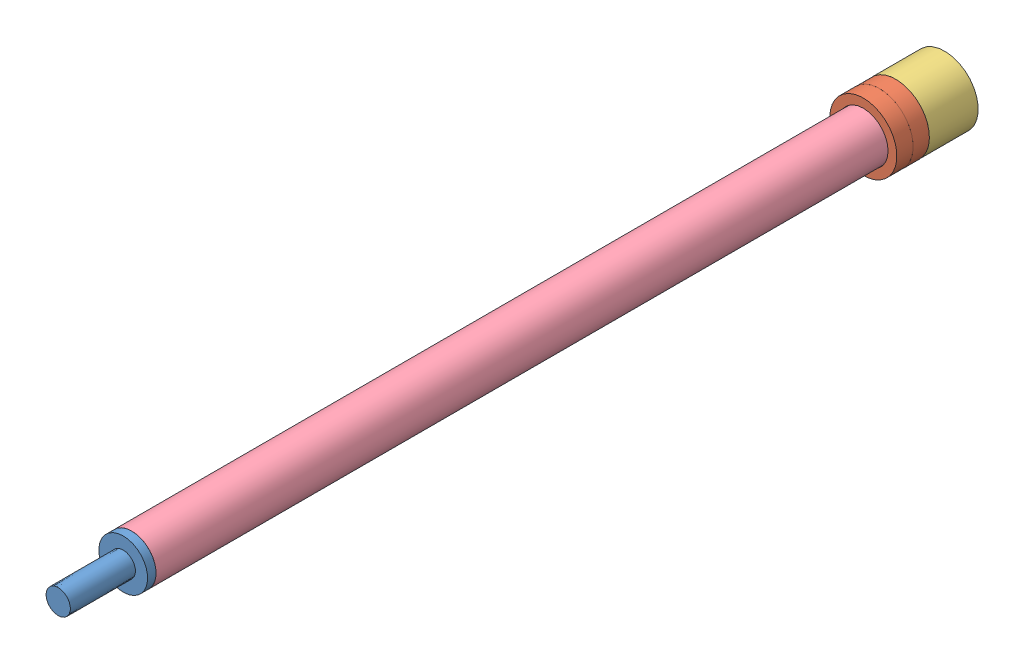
SolidWorks assembly Internal_&.SLDASM, configuration Default (file format 15000). Lengths in mm.
Overall size (35.68 35.68 346.2).
5 component instances, 4 part files, 8 mates.
Components (placement in the parent):
- small_threaded_end_&-1: small_threaded_end_&.SLDPRT [Default] at (0 0 143.51) x (-0.224009 0.974587 0) z (0 0 1) size (19.05 19.05 43.94)
- thin_collar_&-1: thin_collar_&.SLDPRT [Default] at (0 0 -133.35) size (26.21 26.21 6.35)
- thin_collar_&-2: thin_collar_&.SLDPRT [Default] at (0 0 -139.7) x (0.872319 -0.488937 0) z (0 0 1) size (26.21 26.21 6.35)
- small collar_&-1: small collar_&.SLDPRT [Default] at (0 0 -158.75) size (26.21 26.21 19.05)
- small center_tube_&-1: small center_tube_&.SLDPRT [Default] at origin size (19.05 19.05 317.5)
Mates (geometry in assembly coordinates):
- Concentric1: concentric aligned: cylinder of small_threaded_end_&-1 through (0 0 158.75) axis (0 0 -1) radius 8.509; cylinder of small center_tube_&-1 through (0 0 158.75) axis (0 0 -1) radius 8.636
- Coincident1: coincident anti-aligned: plane of small_threaded_end_&-1 through (0 0 158.75) normal (0 0 -1); plane of small center_tube_&-1 through (0 0 158.75) normal (0 0 1)
- Concentric2: concentric aligned: cylinder of small collar_&-1 through (0 0 -139.7) axis (0 0 -1) radius 9.652; cylinder of small center_tube_&-1 through (0 0 158.75) axis (0 0 -1) radius 9.525
- Coincident2: coincident aligned: plane of small collar_&-1 through (0 0 -158.75) normal (0 0 -1); plane of small center_tube_&-1 through (0 0 -158.75) normal (0 0 -1)
- Concentric3: concentric aligned: cylinder of thin_collar_&-2 through (0 0 -133.35) axis (0 0 -1) radius 9.6647; cylinder of small center_tube_&-1 through (0 0 158.75) axis (0 0 -1) radius 9.525
- Coincident3: coincident anti-aligned: plane of thin_collar_&-2 through (0 0 -139.7) normal (0 0 -1); plane of small collar_&-1 through (0 0 -139.7) normal (0 0 1)
- Coincident4: coincident anti-aligned: plane of thin_collar_&-1 through (0 0 -133.35) normal (0 0 -1); plane of thin_collar_&-2 through (0 0 -133.35) normal (0 0 1)
- Concentric4: concentric aligned: cylinder of thin_collar_&-1 through (0 0 -127) axis (0 0 -1) radius 9.6647; cylinder of small center_tube_&-1 through (0 0 158.75) axis (0 0 -1) radius 9.525
